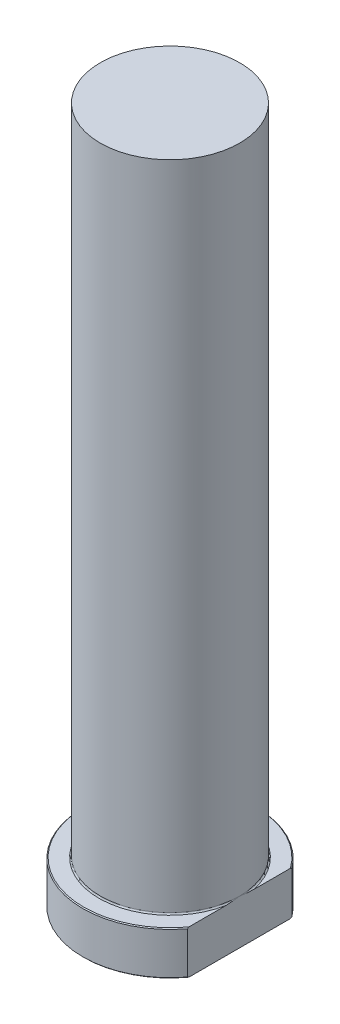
ISO-10303-21;
HEADER;
FILE_DESCRIPTION(('STEP AP214'),'2;1');
FILE_NAME('part.step','',(''),(''),'','','');
FILE_SCHEMA(('AUTOMOTIVE_DESIGN { 1 0 10303 214 1 1 1 1 }'));
ENDSEC;
DATA;
#1=APPLICATION_CONTEXT('core data for automotive mechanical design processes');
#2=APPLICATION_PROTOCOL_DEFINITION('international standard','automotive_design',2000,#1);
#3=PRODUCT_CONTEXT('',#1,'mechanical');
#4=PRODUCT('Part','Part','',(#3));
#5=PRODUCT_RELATED_PRODUCT_CATEGORY('part','',(#4));
#6=PRODUCT_DEFINITION_FORMATION('','',#4);
#7=PRODUCT_DEFINITION_CONTEXT('part definition',#1,'design');
#8=PRODUCT_DEFINITION('design','',#6,#7);
#9=PRODUCT_DEFINITION_SHAPE('','',#8);
#10=(LENGTH_UNIT() NAMED_UNIT(*) SI_UNIT(.MILLI.,.METRE.));
#11=(NAMED_UNIT(*) PLANE_ANGLE_UNIT() SI_UNIT($,.RADIAN.));
#12=(NAMED_UNIT(*) SI_UNIT($,.STERADIAN.) SOLID_ANGLE_UNIT());
#13=UNCERTAINTY_MEASURE_WITH_UNIT(LENGTH_MEASURE(1.E-05),#10,'distance_accuracy_value','');
#14=(GEOMETRIC_REPRESENTATION_CONTEXT(3) GLOBAL_UNCERTAINTY_ASSIGNED_CONTEXT((#13)) GLOBAL_UNIT_ASSIGNED_CONTEXT((#10,
#11,#12)) REPRESENTATION_CONTEXT('',''));
#15=CARTESIAN_POINT('',(0.,0.,0.));
#16=DIRECTION('',(0.,0.,1.));
#17=DIRECTION('',(1.,0.,0.));
#18=AXIS2_PLACEMENT_3D('',#15,#16,#17);
#19=CARTESIAN_POINT('',(0.,0.,0.));
#20=DIRECTION('',(0.,-1.,0.));
#21=DIRECTION('',(0.,0.,-1.));
#22=AXIS2_PLACEMENT_3D('',#19,#20,#21);
#23=PLANE('',#22);
#24=CARTESIAN_POINT('',(0.,0.,0.));
#25=DIRECTION('',(0.,-1.,0.));
#26=DIRECTION('',(0.,0.,-1.));
#27=AXIS2_PLACEMENT_3D('',#24,#25,#26);
#28=CIRCLE('',#27,19.8);
#29=CARTESIAN_POINT('',(16.,0.,11.6636186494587));
#30=VERTEX_POINT('',#29);
#31=CARTESIAN_POINT('',(16.,0.,-11.6636186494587));
#32=VERTEX_POINT('',#31);
#33=EDGE_CURVE('E98',#30,#32,#28,.T.);
#34=ORIENTED_EDGE('',*,*,#33,.T.);
#35=DIRECTION('',(0.,0.,1.));
#36=VECTOR('',#35,1.);
#37=CARTESIAN_POINT('',(16.,0.,-12.));
#38=LINE('',#37,#36);
#39=EDGE_CURVE('E83',#32,#30,#38,.T.);
#40=ORIENTED_EDGE('',*,*,#39,.T.);
#41=EDGE_LOOP('',(#34,#40));
#42=FACE_BOUND('',#41,.T.);
#43=ADVANCED_FACE('F32',(#42),#23,.T.);
#44=CARTESIAN_POINT('',(0.,259.958771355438,0.));
#45=DIRECTION('',(0.,1.,0.));
#46=DIRECTION('',(0.,0.,1.));
#47=AXIS2_PLACEMENT_3D('',#44,#45,#46);
#48=CYLINDRICAL_SURFACE('',#47,20.);
#49=CARTESIAN_POINT('',(0.,9.80000000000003,0.));
#50=DIRECTION('',(0.,1.,0.));
#51=DIRECTION('',(0.,0.,1.));
#52=AXIS2_PLACEMENT_3D('',#49,#50,#51);
#53=CIRCLE('',#52,20.);
#54=CARTESIAN_POINT('',(16.,9.80000000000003,12.));
#55=VERTEX_POINT('',#54);
#56=CARTESIAN_POINT('',(16.,9.80000000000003,-12.));
#57=VERTEX_POINT('',#56);
#58=EDGE_CURVE('E104',#55,#57,#53,.F.);
#59=ORIENTED_EDGE('',*,*,#58,.T.);
#60=DIRECTION('',(0.,-1.,0.));
#61=VECTOR('',#60,1.);
#62=CARTESIAN_POINT('',(16.,160.,-12.));
#63=LINE('',#62,#61);
#64=CARTESIAN_POINT('',(16.,0.199999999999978,-12.));
#65=VERTEX_POINT('',#64);
#66=EDGE_CURVE('E183',#57,#65,#63,.T.);
#67=ORIENTED_EDGE('',*,*,#66,.T.);
#68=CARTESIAN_POINT('',(0.,0.199999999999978,0.));
#69=DIRECTION('',(0.,-1.,0.));
#70=DIRECTION('',(0.,0.,-1.));
#71=AXIS2_PLACEMENT_3D('',#68,#69,#70);
#72=CIRCLE('',#71,20.);
#73=CARTESIAN_POINT('',(16.,0.199999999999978,12.));
#74=VERTEX_POINT('',#73);
#75=EDGE_CURVE('E100',#65,#74,#72,.F.);
#76=ORIENTED_EDGE('',*,*,#75,.T.);
#77=DIRECTION('',(0.,-1.,0.));
#78=VECTOR('',#77,1.);
#79=CARTESIAN_POINT('',(16.,160.,12.));
#80=LINE('',#79,#78);
#81=EDGE_CURVE('E93',#55,#74,#80,.T.);
#82=ORIENTED_EDGE('',*,*,#81,.F.);
#83=EDGE_LOOP('',(#59,#67,#76,#82));
#84=FACE_BOUND('',#83,.T.);
#85=ADVANCED_FACE('F158',(#84),#48,.T.);
#86=CARTESIAN_POINT('',(-20.,10.,0.));
#87=DIRECTION('',(0.,1.,0.));
#88=DIRECTION('',(0.,0.,1.));
#89=AXIS2_PLACEMENT_3D('',#86,#87,#88);
#90=PLANE('',#89);
#91=CARTESIAN_POINT('',(0.,10.,0.));
#92=DIRECTION('',(0.,1.,0.));
#93=DIRECTION('',(0.,0.,1.));
#94=AXIS2_PLACEMENT_3D('',#91,#92,#93);
#95=CIRCLE('',#94,19.8);
#96=CARTESIAN_POINT('',(16.,10.,-11.6636186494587));
#97=VERTEX_POINT('',#96);
#98=CARTESIAN_POINT('',(16.,10.,11.6636186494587));
#99=VERTEX_POINT('',#98);
#100=EDGE_CURVE('E178',#97,#99,#95,.T.);
#101=ORIENTED_EDGE('',*,*,#100,.T.);
#102=DIRECTION('',(0.,0.,-1.));
#103=VECTOR('',#102,1.);
#104=CARTESIAN_POINT('',(16.,10.,0.));
#105=LINE('',#104,#103);
#106=CARTESIAN_POINT('',(16.,10.,3.1128764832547));
#107=VERTEX_POINT('',#106);
#108=EDGE_CURVE('E57',#99,#107,#105,.T.);
#109=ORIENTED_EDGE('',*,*,#108,.T.);
#110=CARTESIAN_POINT('',(0.,10.,0.));
#111=DIRECTION('',(0.,1.,0.));
#112=DIRECTION('',(0.,0.,1.));
#113=AXIS2_PLACEMENT_3D('',#110,#111,#112);
#114=CIRCLE('',#113,16.3);
#115=CARTESIAN_POINT('',(16.,10.,-3.11287648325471));
#116=VERTEX_POINT('',#115);
#117=EDGE_CURVE('E107',#107,#116,#114,.F.);
#118=ORIENTED_EDGE('',*,*,#117,.T.);
#119=EDGE_CURVE('E136',#116,#97,#105,.T.);
#120=ORIENTED_EDGE('',*,*,#119,.T.);
#121=EDGE_LOOP('',(#101,#109,#118,#120));
#122=FACE_BOUND('',#121,.T.);
#123=ADVANCED_FACE('F147',(#122),#90,.T.);
#124=CARTESIAN_POINT('',(0.,10.,0.));
#125=DIRECTION('',(0.,-1.,0.));
#126=DIRECTION('',(0.,0.,-1.));
#127=AXIS2_PLACEMENT_3D('',#124,#125,#126);
#128=CONICAL_SURFACE('',#127,19.8,0.785398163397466);
#129=ORIENTED_EDGE('',*,*,#58,.F.);
#130=CARTESIAN_POINT('',(16.,-1.07064884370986,26.4006999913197));
#131=CARTESIAN_POINT('',(16.,-0.733156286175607,26.0060486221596));
#132=CARTESIAN_POINT('',(16.,-0.396819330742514,25.6104050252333));
#133=CARTESIAN_POINT('',(16.,0.273206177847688,24.8168690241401));
#134=CARTESIAN_POINT('',(16.,0.606894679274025,24.4189765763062));
#135=CARTESIAN_POINT('',(16.,1.27144329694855,23.6204891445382));
#136=CARTESIAN_POINT('',(16.,1.60230187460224,23.2198928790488));
#137=CARTESIAN_POINT('',(16.,2.26059114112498,22.4158945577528));
#138=CARTESIAN_POINT('',(16.,2.58802184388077,22.0124925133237));
#139=CARTESIAN_POINT('',(16.,3.24766747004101,21.1916872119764));
#140=CARTESIAN_POINT('',(16.,3.57977582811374,20.7741982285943));
#141=CARTESIAN_POINT('',(16.,4.23919239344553,19.9354474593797));
#142=CARTESIAN_POINT('',(16.,4.56650063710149,19.5141857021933));
#143=CARTESIAN_POINT('',(16.,5.21544461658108,18.6674666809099));
#144=CARTESIAN_POINT('',(16.,5.53708166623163,18.2420104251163));
#145=CARTESIAN_POINT('',(16.,6.17378218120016,17.3861997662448));
#146=CARTESIAN_POINT('',(16.,6.48884565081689,16.9558453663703));
#147=CARTESIAN_POINT('',(16.,7.11176935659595,16.0887218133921));
#148=CARTESIAN_POINT('',(16.,7.41961501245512,15.6519421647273));
#149=CARTESIAN_POINT('',(16.,8.02597466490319,14.7719292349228));
#150=CARTESIAN_POINT('',(16.,8.32448855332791,14.3286958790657));
#151=CARTESIAN_POINT('',(16.,8.9105299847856,13.4344389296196));
#152=CARTESIAN_POINT('',(16.,9.19804754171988,12.9834087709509));
#153=CARTESIAN_POINT('',(16.,9.75938980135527,12.0728858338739));
#154=CARTESIAN_POINT('',(16.,10.0332147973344,11.6133932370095));
#155=CARTESIAN_POINT('',(16.,10.5615335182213,10.6892898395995));
#156=CARTESIAN_POINT('',(16.,10.816189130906,10.2247720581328));
#157=CARTESIAN_POINT('',(16.,11.3053445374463,9.28510847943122));
#158=CARTESIAN_POINT('',(16.,11.5398419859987,8.80996145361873));
#159=CARTESIAN_POINT('',(16.,11.9836278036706,7.84885100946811));
#160=CARTESIAN_POINT('',(16.,12.1929556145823,7.36290596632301));
#161=CARTESIAN_POINT('',(16.,12.5811435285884,6.37912337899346));
#162=CARTESIAN_POINT('',(16.,12.7600157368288,5.88129064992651));
#163=CARTESIAN_POINT('',(16.,13.0861366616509,4.85753764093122));
#164=CARTESIAN_POINT('',(16.,13.2321910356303,4.33122827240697));
#165=CARTESIAN_POINT('',(16.,13.4164504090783,3.533797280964));
#166=CARTESIAN_POINT('',(16.,13.4720698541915,3.26663533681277));
#167=CARTESIAN_POINT('',(16.,13.5709016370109,2.73003918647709));
#168=CARTESIAN_POINT('',(16.,13.6141156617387,2.4606052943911));
#169=CARTESIAN_POINT('',(16.,13.6872774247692,1.92117630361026));
#170=CARTESIAN_POINT('',(16.,13.7172841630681,1.65118922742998));
#171=CARTESIAN_POINT('',(16.,13.7638048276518,1.11005042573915));
#172=CARTESIAN_POINT('',(16.,13.7803188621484,0.838898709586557));
#173=CARTESIAN_POINT('',(16.,13.7995586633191,0.296109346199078));
#174=CARTESIAN_POINT('',(16.,13.8022847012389,0.0244717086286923));
#175=CARTESIAN_POINT('',(16.,13.7939006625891,-0.518588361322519));
#176=CARTESIAN_POINT('',(16.,13.7827905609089,-0.790010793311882));
#177=CARTESIAN_POINT('',(16.,13.7469663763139,-1.33142514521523));
#178=CARTESIAN_POINT('',(16.,13.7222788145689,-1.60141882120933));
#179=CARTESIAN_POINT('',(16.,13.6597540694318,-2.13989179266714));
#180=CARTESIAN_POINT('',(16.,13.6219151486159,-2.40837088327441));
#181=CARTESIAN_POINT('',(16.,13.4895557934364,-3.21066813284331));
#182=CARTESIAN_POINT('',(16.,13.3761851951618,-3.74145456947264));
#183=CARTESIAN_POINT('',(16.,13.104850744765,-4.79469191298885));
#184=CARTESIAN_POINT('',(16.,12.9466209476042,-5.31707285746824));
#185=CARTESIAN_POINT('',(16.,12.6815624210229,-6.09095035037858));
#186=CARTESIAN_POINT('',(16.,12.5885858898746,-6.34730496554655));
#187=CARTESIAN_POINT('',(16.,12.3942381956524,-6.85681818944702));
#188=CARTESIAN_POINT('',(16.,12.2928668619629,-7.10997673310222));
#189=CARTESIAN_POINT('',(16.,11.9087737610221,-8.02895093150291));
#190=CARTESIAN_POINT('',(16.,11.6032209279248,-8.68528507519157));
#191=CARTESIAN_POINT('',(16.,10.9520387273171,-9.97785473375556));
#192=CARTESIAN_POINT('',(16.,10.6063845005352,-10.6140774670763));
#193=CARTESIAN_POINT('',(16.,9.88410853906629,-11.8704402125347));
#194=CARTESIAN_POINT('',(16.,9.50742027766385,-12.4905417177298));
#195=CARTESIAN_POINT('',(16.,8.73104614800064,-13.7158784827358));
#196=CARTESIAN_POINT('',(16.,8.33136526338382,-14.3211169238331));
#197=CARTESIAN_POINT('',(16.,7.51225576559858,-15.5221520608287));
#198=CARTESIAN_POINT('',(16.,7.09274396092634,-16.1178917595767));
#199=CARTESIAN_POINT('',(16.,6.23957009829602,-17.2991512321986));
#200=CARTESIAN_POINT('',(16.,5.80590743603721,-17.884670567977));
#201=CARTESIAN_POINT('',(16.,4.92783508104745,-19.0464967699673));
#202=CARTESIAN_POINT('',(16.,4.48343853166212,-19.6228135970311));
#203=CARTESIAN_POINT('',(16.,3.58557777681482,-20.7683027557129));
#204=CARTESIAN_POINT('',(16.,3.13211380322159,-21.3374752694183));
#205=CARTESIAN_POINT('',(16.,2.36744022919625,-22.2844266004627));
#206=CARTESIAN_POINT('',(16.,2.05826684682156,-22.6638539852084));
#207=CARTESIAN_POINT('',(16.,1.43690833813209,-23.4203229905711));
#208=CARTESIAN_POINT('',(16.,1.12472279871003,-23.7973642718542));
#209=CARTESIAN_POINT('',(16.,0.499956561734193,-24.5465888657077));
#210=CARTESIAN_POINT('',(16.,0.187394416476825,-24.918787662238));
#211=CARTESIAN_POINT('',(16.,-0.439990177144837,-25.6611808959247));
#212=CARTESIAN_POINT('',(16.,-0.754812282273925,-26.031375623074));
#213=CARTESIAN_POINT('',(16.,-1.07064884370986,-26.4006999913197));
#214=B_SPLINE_CURVE_WITH_KNOTS('',3,(#130,#131,#132,#133,#134,#135,#136,#137,#138,#139,#140,
#141,#142,#143,#144,#145,#146,#147,#148,#149,#150,#151,#152,#153,#154,#155,#156,#157,#158,#159,
#160,#161,#162,#163,#164,#165,#166,#167,#168,#169,#170,#171,#172,#173,#174,#175,#176,#177,#178,
#179,#180,#181,#182,#183,#184,#185,#186,#187,#188,#189,#190,#191,#192,#193,#194,#195,#196,#197,
#198,#199,#200,#201,#202,#203,#204,#205,#206,#207,#208,#209,#210,#211,#212,#213),.UNSPECIFIED.,
.F.,.F.,(4,2,2,2,2,2,2,2,2,2,2,2,2,2,2,2,2,2,2,2,2,2,2,2,2,2,2,2,2,2,2,2,2,2,2,2,2,2,2,2,2,4),
(0.,1.55783999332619,3.11571034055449,4.67437978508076,6.23304291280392,7.83343038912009,
9.43380572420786,11.0338053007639,12.6338038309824,14.2367959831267,15.8398067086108,
17.4442401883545,19.0486392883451,20.6374598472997,22.2264650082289,23.8129467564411,
25.398796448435,27.0353648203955,27.853792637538,28.6721091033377,29.4867319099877,
30.3013481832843,31.1159484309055,31.9305501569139,32.7435663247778,33.556689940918,
35.1826128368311,36.8183840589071,37.6363419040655,38.4543163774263,40.6241539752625,
42.7953439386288,44.9713157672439,47.1468177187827,49.3324366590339,51.5181490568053,
53.7013086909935,55.8844125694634,57.3527237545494,58.8212392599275,60.2793254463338,
61.737194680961),.UNSPECIFIED.);
#215=EDGE_CURVE('E135',#55,#99,#214,.T.);
#216=ORIENTED_EDGE('',*,*,#215,.T.);
#217=ORIENTED_EDGE('',*,*,#100,.F.);
#218=EDGE_CURVE('E127',#97,#57,#214,.T.);
#219=ORIENTED_EDGE('',*,*,#218,.T.);
#220=EDGE_LOOP('',(#129,#216,#217,#219));
#221=FACE_BOUND('',#220,.T.);
#222=ADVANCED_FACE('F143',(#221),#128,.T.);
#223=CARTESIAN_POINT('',(0.,0.199999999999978,0.));
#224=DIRECTION('',(0.,1.,0.));
#225=DIRECTION('',(0.,0.,1.));
#226=AXIS2_PLACEMENT_3D('',#223,#224,#225);
#227=CONICAL_SURFACE('',#226,20.,0.785398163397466);
#228=ORIENTED_EDGE('',*,*,#75,.F.);
#229=CARTESIAN_POINT('',(16.,11.0706488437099,-26.4006999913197));
#230=CARTESIAN_POINT('',(16.,10.7331562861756,-26.0060486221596));
#231=CARTESIAN_POINT('',(16.,10.3968193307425,-25.6104050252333));
#232=CARTESIAN_POINT('',(16.,9.72679382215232,-24.8168690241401));
#233=CARTESIAN_POINT('',(16.,9.39310532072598,-24.4189765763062));
#234=CARTESIAN_POINT('',(16.,8.72855670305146,-23.6204891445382));
#235=CARTESIAN_POINT('',(16.,8.39769812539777,-23.2198928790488));
#236=CARTESIAN_POINT('',(16.,7.73940885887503,-22.4158945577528));
#237=CARTESIAN_POINT('',(16.,7.41197815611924,-22.0124925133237));
#238=CARTESIAN_POINT('',(16.,6.752332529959,-21.1916872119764));
#239=CARTESIAN_POINT('',(16.,6.42022417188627,-20.7741982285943));
#240=CARTESIAN_POINT('',(16.,5.76080760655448,-19.9354474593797));
#241=CARTESIAN_POINT('',(16.,5.43349936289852,-19.5141857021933));
#242=CARTESIAN_POINT('',(16.,4.78455538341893,-18.6674666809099));
#243=CARTESIAN_POINT('',(16.,4.46291833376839,-18.2420104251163));
#244=CARTESIAN_POINT('',(16.,3.82621781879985,-17.3861997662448));
#245=CARTESIAN_POINT('',(16.,3.51115434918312,-16.9558453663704));
#246=CARTESIAN_POINT('',(16.,2.88823064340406,-16.0887218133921));
#247=CARTESIAN_POINT('',(16.,2.58038498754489,-15.6519421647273));
#248=CARTESIAN_POINT('',(16.,1.97402533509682,-14.7719292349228));
#249=CARTESIAN_POINT('',(16.,1.6755114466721,-14.3286958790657));
#250=CARTESIAN_POINT('',(16.,1.08947001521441,-13.4344389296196));
#251=CARTESIAN_POINT('',(16.,0.801952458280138,-12.9834087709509));
#252=CARTESIAN_POINT('',(16.,0.240610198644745,-12.0728858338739));
#253=CARTESIAN_POINT('',(16.,-0.0332147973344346,-11.6133932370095));
#254=CARTESIAN_POINT('',(16.,-0.561533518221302,-10.6892898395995));
#255=CARTESIAN_POINT('',(16.,-0.816189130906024,-10.2247720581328));
#256=CARTESIAN_POINT('',(16.,-1.30534453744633,-9.28510847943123));
#257=CARTESIAN_POINT('',(16.,-1.5398419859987,-8.80996145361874));
#258=CARTESIAN_POINT('',(16.,-1.98362780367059,-7.84885100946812));
#259=CARTESIAN_POINT('',(16.,-2.19295561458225,-7.36290596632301));
#260=CARTESIAN_POINT('',(16.,-2.58114352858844,-6.37912337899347));
#261=CARTESIAN_POINT('',(16.,-2.76001573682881,-5.88129064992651));
#262=CARTESIAN_POINT('',(16.,-3.08613666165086,-4.85753764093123));
#263=CARTESIAN_POINT('',(16.,-3.23219103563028,-4.33122827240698));
#264=CARTESIAN_POINT('',(16.,-3.41645040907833,-3.53379728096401));
#265=CARTESIAN_POINT('',(16.,-3.47206985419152,-3.26663533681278));
#266=CARTESIAN_POINT('',(16.,-3.57090163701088,-2.7300391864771));
#267=CARTESIAN_POINT('',(16.,-3.61411566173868,-2.46060529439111));
#268=CARTESIAN_POINT('',(16.,-3.6872774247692,-1.92117630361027));
#269=CARTESIAN_POINT('',(16.,-3.71728416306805,-1.65118922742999));
#270=CARTESIAN_POINT('',(16.,-3.76380482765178,-1.11005042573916));
#271=CARTESIAN_POINT('',(16.,-3.78031886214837,-0.838898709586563));
#272=CARTESIAN_POINT('',(16.,-3.79955866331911,-0.296109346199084));
#273=CARTESIAN_POINT('',(16.,-3.80228470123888,-0.0244717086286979));
#274=CARTESIAN_POINT('',(16.,-3.79390066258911,0.518588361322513));
#275=CARTESIAN_POINT('',(16.,-3.78279056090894,0.790010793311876));
#276=CARTESIAN_POINT('',(16.,-3.74696637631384,1.33142514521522));
#277=CARTESIAN_POINT('',(16.,-3.7222788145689,1.60141882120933));
#278=CARTESIAN_POINT('',(16.,-3.65975406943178,2.13989179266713));
#279=CARTESIAN_POINT('',(16.,-3.62191514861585,2.40837088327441));
#280=CARTESIAN_POINT('',(16.,-3.48955579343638,3.21066813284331));
#281=CARTESIAN_POINT('',(16.,-3.37618519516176,3.74145456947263));
#282=CARTESIAN_POINT('',(16.,-3.10485074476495,4.79469191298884));
#283=CARTESIAN_POINT('',(16.,-2.94662094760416,5.31707285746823));
#284=CARTESIAN_POINT('',(16.,-2.68156242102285,6.09095035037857));
#285=CARTESIAN_POINT('',(16.,-2.58858588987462,6.34730496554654));
#286=CARTESIAN_POINT('',(16.,-2.39423819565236,6.85681818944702));
#287=CARTESIAN_POINT('',(16.,-2.29286686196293,7.10997673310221));
#288=CARTESIAN_POINT('',(16.,-1.90877376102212,8.0289509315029));
#289=CARTESIAN_POINT('',(16.,-1.6032209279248,8.68528507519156));
#290=CARTESIAN_POINT('',(16.,-0.952038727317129,9.97785473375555));
#291=CARTESIAN_POINT('',(16.,-0.606384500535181,10.6140774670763));
#292=CARTESIAN_POINT('',(16.,0.115891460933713,11.8704402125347));
#293=CARTESIAN_POINT('',(16.,0.492579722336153,12.4905417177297));
#294=CARTESIAN_POINT('',(16.,1.26895385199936,13.7158784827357));
#295=CARTESIAN_POINT('',(16.,1.66863473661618,14.3211169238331));
#296=CARTESIAN_POINT('',(16.,2.48774423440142,15.5221520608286));
#297=CARTESIAN_POINT('',(16.,2.90725603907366,16.1178917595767));
#298=CARTESIAN_POINT('',(16.,3.76042990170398,17.2991512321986));
#299=CARTESIAN_POINT('',(16.,4.19409256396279,17.884670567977));
#300=CARTESIAN_POINT('',(16.,5.07216491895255,19.0464967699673));
#301=CARTESIAN_POINT('',(16.,5.51656146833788,19.622813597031));
#302=CARTESIAN_POINT('',(16.,6.41442222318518,20.7683027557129));
#303=CARTESIAN_POINT('',(16.,6.8678861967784,21.3374752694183));
#304=CARTESIAN_POINT('',(16.,7.63255977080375,22.2844266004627));
#305=CARTESIAN_POINT('',(16.,7.94173315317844,22.6638539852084));
#306=CARTESIAN_POINT('',(16.,8.56309166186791,23.4203229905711));
#307=CARTESIAN_POINT('',(16.,8.87527720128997,23.7973642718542));
#308=CARTESIAN_POINT('',(16.,9.50004343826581,24.5465888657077));
#309=CARTESIAN_POINT('',(16.,9.81260558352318,24.918787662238));
#310=CARTESIAN_POINT('',(16.,10.4399901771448,25.6611808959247));
#311=CARTESIAN_POINT('',(16.,10.7548122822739,26.031375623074));
#312=CARTESIAN_POINT('',(16.,11.0706488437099,26.4006999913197));
#313=B_SPLINE_CURVE_WITH_KNOTS('',3,(#229,#230,#231,#232,#233,#234,#235,#236,#237,#238,#239,
#240,#241,#242,#243,#244,#245,#246,#247,#248,#249,#250,#251,#252,#253,#254,#255,#256,#257,#258,
#259,#260,#261,#262,#263,#264,#265,#266,#267,#268,#269,#270,#271,#272,#273,#274,#275,#276,#277,
#278,#279,#280,#281,#282,#283,#284,#285,#286,#287,#288,#289,#290,#291,#292,#293,#294,#295,#296,
#297,#298,#299,#300,#301,#302,#303,#304,#305,#306,#307,#308,#309,#310,#311,#312),.UNSPECIFIED.,
.F.,.F.,(4,2,2,2,2,2,2,2,2,2,2,2,2,2,2,2,2,2,2,2,2,2,2,2,2,2,2,2,2,2,2,2,2,2,2,2,2,2,2,2,2,4),
(0.,1.55783999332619,3.11571034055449,4.67437978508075,6.23304291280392,7.83343038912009,
9.43380572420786,11.0338053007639,12.6338038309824,14.2367959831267,15.8398067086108,
17.4442401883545,19.0486392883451,20.6374598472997,22.2264650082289,23.8129467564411,
25.398796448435,27.0353648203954,27.853792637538,28.6721091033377,29.4867319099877,
30.3013481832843,31.1159484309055,31.9305501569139,32.7435663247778,33.556689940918,
35.1826128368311,36.8183840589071,37.6363419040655,38.4543163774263,40.6241539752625,
42.7953439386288,44.9713157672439,47.1468177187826,49.3324366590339,51.5181490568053,
53.7013086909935,55.8844125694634,57.3527237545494,58.8212392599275,60.2793254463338,
61.737194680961),.UNSPECIFIED.);
#314=EDGE_CURVE('E86',#65,#32,#313,.T.);
#315=ORIENTED_EDGE('',*,*,#314,.T.);
#316=ORIENTED_EDGE('',*,*,#33,.F.);
#317=EDGE_CURVE('E89',#30,#74,#313,.T.);
#318=ORIENTED_EDGE('',*,*,#317,.T.);
#319=EDGE_LOOP('',(#228,#315,#316,#318));
#320=FACE_BOUND('',#319,.T.);
#321=ADVANCED_FACE('F97',(#320),#227,.T.);
#322=CARTESIAN_POINT('',(0.,10.3,0.));
#323=DIRECTION('',(0.,1.,0.));
#324=DIRECTION('',(0.,0.,1.));
#325=AXIS2_PLACEMENT_3D('',#322,#323,#324);
#326=TOROIDAL_SURFACE('',#325,16.3,0.3);
#327=CARTESIAN_POINT('',(16.,10.3,0.));
#328=CARTESIAN_POINT('',(16.,10.3000006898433,-5.33715911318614E-09));
#329=CARTESIAN_POINT('',(16.,10.3000013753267,-5.90477996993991E-07));
#330=CARTESIAN_POINT('',(16.,10.3000026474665,-1.99315110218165E-06));
#331=CARTESIAN_POINT('',(16.,10.3000031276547,-2.82387138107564E-06));
#332=CARTESIAN_POINT('',(16.,10.300004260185,-4.93201352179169E-06));
#333=CARTESIAN_POINT('',(16.,10.300004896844,-6.24688723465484E-06));
#334=CARTESIAN_POINT('',(16.,10.3000059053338,-8.79561581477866E-06));
#335=CARTESIAN_POINT('',(16.,10.3000062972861,-1.00244169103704E-05));
#336=CARTESIAN_POINT('',(16.,10.3000079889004,-1.53269558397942E-05));
#337=CARTESIAN_POINT('',(16.,10.3000092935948,-1.94146126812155E-05));
#338=CARTESIAN_POINT('',(16.,10.3000111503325,-2.70530674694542E-05));
#339=CARTESIAN_POINT('',(16.,10.300011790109,-3.05834546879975E-05));
#340=CARTESIAN_POINT('',(16.,10.3000164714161,-5.69924666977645E-05));
#341=CARTESIAN_POINT('',(16.,10.3000199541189,-7.99464318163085E-05));
#342=CARTESIAN_POINT('',(16.,10.3000322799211,-0.000171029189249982));
#343=CARTESIAN_POINT('',(16.,10.3000382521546,-0.000239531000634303));
#344=CARTESIAN_POINT('',(16.,10.3000656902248,-0.00050618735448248));
#345=CARTESIAN_POINT('',(16.,10.3000950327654,-0.0007033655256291));
#346=CARTESIAN_POINT('',(16.,10.3002038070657,-0.0014556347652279));
#347=CARTESIAN_POINT('',(16.,10.300277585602,-0.00201139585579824));
#348=CARTESIAN_POINT('',(16.,10.3005644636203,-0.00414914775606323));
#349=CARTESIAN_POINT('',(16.,10.300783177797,-0.00573048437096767));
#350=CARTESIAN_POINT('',(16.,10.3018172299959,-0.0132287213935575));
#351=CARTESIAN_POINT('',(16.,10.3026243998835,-0.0191465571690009));
#352=CARTESIAN_POINT('',(16.,10.3110865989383,-0.0811528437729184));
#353=CARTESIAN_POINT('',(16.,10.3187815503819,-0.137236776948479));
#354=CARTESIAN_POINT('',(16.,10.3348868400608,-0.255096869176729));
#355=CARTESIAN_POINT('',(16.,10.343290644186,-0.316873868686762));
#356=CARTESIAN_POINT('',(16.,10.3571569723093,-0.419331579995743));
#357=CARTESIAN_POINT('',(16.,10.3626434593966,-0.460008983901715));
#358=CARTESIAN_POINT('',(16.,10.3734224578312,-0.540334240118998));
#359=CARTESIAN_POINT('',(16.,10.3787163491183,-0.579981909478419));
#360=CARTESIAN_POINT('',(16.,10.4083966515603,-0.803619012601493));
#361=CARTESIAN_POINT('',(16.,10.4321379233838,-0.987696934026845));
#362=CARTESIAN_POINT('',(16.,10.4771585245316,-1.35808125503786));
#363=CARTESIAN_POINT('',(16.,10.4984099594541,-1.54439106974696));
#364=CARTESIAN_POINT('',(16.,10.5392977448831,-1.94430528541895));
#365=CARTESIAN_POINT('',(16.,10.5582626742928,-2.15798298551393));
#366=CARTESIAN_POINT('',(16.,10.5798230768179,-2.47853128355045));
#367=CARTESIAN_POINT('',(16.,10.5858566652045,-2.58516682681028));
#368=CARTESIAN_POINT('',(16.,10.5950189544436,-2.79855398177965));
#369=CARTESIAN_POINT('',(16.,10.5981480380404,-2.90530557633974));
#370=CARTESIAN_POINT('',(16.,10.6006064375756,-3.11480969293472));
#371=CARTESIAN_POINT('',(16.,10.600075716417,-3.21755992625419));
#372=CARTESIAN_POINT('',(16.,10.5957602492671,-3.37181907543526));
#373=CARTESIAN_POINT('',(16.,10.593726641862,-3.42337702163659));
#374=CARTESIAN_POINT('',(16.,10.5882429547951,-3.52640582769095));
#375=CARTESIAN_POINT('',(16.,10.584793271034,-3.57787670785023));
#376=CARTESIAN_POINT('',(16.,10.5763123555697,-3.67890194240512));
#377=CARTESIAN_POINT('',(16.,10.5713398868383,-3.72846106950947));
#378=CARTESIAN_POINT('',(16.,10.5593485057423,-3.82738811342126));
#379=CARTESIAN_POINT('',(16.,10.5523274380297,-3.87675577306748));
#380=CARTESIAN_POINT('',(16.,10.5356271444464,-3.97473922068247));
#381=CARTESIAN_POINT('',(16.,10.5259654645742,-4.02335780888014));
#382=CARTESIAN_POINT('',(16.,10.5085240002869,-4.09553189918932));
#383=CARTESIAN_POINT('',(16.,10.5022253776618,-4.11944402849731));
#384=CARTESIAN_POINT('',(16.,10.4883597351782,-4.16689390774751));
#385=CARTESIAN_POINT('',(16.,10.4807934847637,-4.19043187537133));
#386=CARTESIAN_POINT('',(16.,10.468072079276,-4.22548932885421));
#387=CARTESIAN_POINT('',(16.,10.463554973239,-4.23724015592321));
#388=CARTESIAN_POINT('',(16.,10.4539723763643,-4.2605292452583));
#389=CARTESIAN_POINT('',(16.,10.4489064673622,-4.27206733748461));
#390=CARTESIAN_POINT('',(16.,10.4380905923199,-4.29485009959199));
#391=CARTESIAN_POINT('',(16.,10.4323392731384,-4.30609413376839));
#392=CARTESIAN_POINT('',(16.,10.4199753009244,-4.32809262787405));
#393=CARTESIAN_POINT('',(16.,10.4133636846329,-4.33884765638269));
#394=CARTESIAN_POINT('',(16.,10.3989169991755,-4.35969720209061));
#395=CARTESIAN_POINT('',(16.,10.3910687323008,-4.36978269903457));
#396=CARTESIAN_POINT('',(16.,10.3737930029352,-4.38847604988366));
#397=CARTESIAN_POINT('',(16.,10.3643793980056,-4.39709563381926));
#398=CARTESIAN_POINT('',(16.,10.349684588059,-4.40721260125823));
#399=CARTESIAN_POINT('',(16.,10.3452411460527,-4.40991204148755));
#400=CARTESIAN_POINT('',(16.,10.3360120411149,-4.41465735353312));
#401=CARTESIAN_POINT('',(16.,10.331226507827,-4.41670347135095));
#402=CARTESIAN_POINT('',(16.,10.321316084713,-4.41997867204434));
#403=CARTESIAN_POINT('',(16.,10.3161880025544,-4.42119837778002));
#404=CARTESIAN_POINT('',(16.,10.3057936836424,-4.42262740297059));
#405=CARTESIAN_POINT('',(16.,10.3005276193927,-4.42283792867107));
#406=CARTESIAN_POINT('',(16.,10.2906214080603,-4.42225569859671));
#407=CARTESIAN_POINT('',(16.,10.285974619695,-4.42156796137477));
#408=CARTESIAN_POINT('',(16.,10.2768560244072,-4.41944337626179));
#409=CARTESIAN_POINT('',(16.,10.2723843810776,-4.41800584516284));
#410=CARTESIAN_POINT('',(16.,10.2619701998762,-4.41381248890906));
#411=CARTESIAN_POINT('',(16.,10.2561483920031,-4.4107598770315));
#412=CARTESIAN_POINT('',(16.,10.2450526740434,-4.40378684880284));
#413=CARTESIAN_POINT('',(16.,10.239780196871,-4.39986424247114));
#414=CARTESIAN_POINT('',(16.,10.2257729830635,-4.38808908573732));
#415=CARTESIAN_POINT('',(16.,10.2175965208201,-4.37958133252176));
#416=CARTESIAN_POINT('',(16.,10.2024790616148,-4.36154434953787));
#417=CARTESIAN_POINT('',(16.,10.1955419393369,-4.35201206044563));
#418=CARTESIAN_POINT('',(16.,10.1791886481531,-4.32717029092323));
#419=CARTESIAN_POINT('',(16.,10.1703884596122,-4.31145991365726));
#420=CARTESIAN_POINT('',(16.,10.154248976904,-4.2792945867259));
#421=CARTESIAN_POINT('',(16.,10.1469131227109,-4.26283799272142));
#422=CARTESIAN_POINT('',(16.,10.1332947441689,-4.22939871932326));
#423=CARTESIAN_POINT('',(16.,10.1270179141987,-4.2124137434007));
#424=CARTESIAN_POINT('',(16.,10.1153239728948,-4.17817736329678));
#425=CARTESIAN_POINT('',(16.,10.1099058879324,-4.16092628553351));
#426=CARTESIAN_POINT('',(16.,10.0949674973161,-4.10989946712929));
#427=CARTESIAN_POINT('',(16.,10.0863847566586,-4.07584989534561));
#428=CARTESIAN_POINT('',(16.,10.0710343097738,-4.00733871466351));
#429=CARTESIAN_POINT('',(16.,10.0642677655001,-3.97287685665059));
#430=CARTESIAN_POINT('',(16.,10.0460186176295,-3.86898411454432));
#431=CARTESIAN_POINT('',(16.,10.036623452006,-3.79918851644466));
#432=CARTESIAN_POINT('',(16.,10.0215249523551,-3.65915321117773));
#433=CARTESIAN_POINT('',(16.,10.0158261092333,-3.58891306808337));
#434=CARTESIAN_POINT('',(16.,10.0072116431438,-3.44836432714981));
#435=CARTESIAN_POINT('',(16.,10.00429218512,-3.37805595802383));
#436=CARTESIAN_POINT('',(16.,10.000668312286,-3.23904020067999));
#437=CARTESIAN_POINT('',(16.,9.99991350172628,-3.17033397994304));
#438=CARTESIAN_POINT('',(16.,10.0001018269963,-3.03292208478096));
#439=CARTESIAN_POINT('',(16.,10.0010450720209,-2.96421641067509));
#440=CARTESIAN_POINT('',(16.,10.0059904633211,-2.75810886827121));
#441=CARTESIAN_POINT('',(16.,10.0121089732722,-2.62075798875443));
#442=CARTESIAN_POINT('',(16.,10.0284391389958,-2.34612718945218));
#443=CARTESIAN_POINT('',(16.,10.0386564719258,-2.20884763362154));
#444=CARTESIAN_POINT('',(16.,10.0621466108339,-1.93454208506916));
#445=CARTESIAN_POINT('',(16.,10.075419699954,-1.79751611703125));
#446=CARTESIAN_POINT('',(16.,10.118522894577,-1.38740066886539));
#447=CARTESIAN_POINT('',(16.,10.1516806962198,-1.11466812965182));
#448=CARTESIAN_POINT('',(16.,10.2220528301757,-0.569702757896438));
#449=CARTESIAN_POINT('',(16.,10.259267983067,-0.297470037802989));
#450=CARTESIAN_POINT('',(16.,10.2965515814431,-0.0251841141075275));
#451=CARTESIAN_POINT('',(16.,10.2965597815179,-0.0251242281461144));
#452=CARTESIAN_POINT('',(16.,10.2972621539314,-0.019994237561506));
#453=CARTESIAN_POINT('',(16.,10.2979507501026,-0.0149234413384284));
#454=CARTESIAN_POINT('',(16.,10.2989595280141,-0.00761717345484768));
#455=CARTESIAN_POINT('',(16.,10.2992705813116,-0.00538056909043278));
#456=CARTESIAN_POINT('',(16.,10.2996656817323,-0.00242425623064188));
#457=CARTESIAN_POINT('',(16.,10.2997604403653,-0.00170587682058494));
#458=CARTESIAN_POINT('',(16.,10.2998960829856,-0.000765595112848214));
#459=CARTESIAN_POINT('',(16.,10.2999290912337,-0.000542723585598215));
#460=CARTESIAN_POINT('',(16.,10.2999593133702,-0.000246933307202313));
#461=CARTESIAN_POINT('',(16.,10.2999656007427,-0.000175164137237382));
#462=CARTESIAN_POINT('',(16.,10.2999790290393,-8.05668880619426E-05));
#463=CARTESIAN_POINT('',(16.,10.2999827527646,-5.72823548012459E-05));
#464=CARTESIAN_POINT('',(16.,10.2999877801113,-3.05492734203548E-05));
#465=CARTESIAN_POINT('',(16.,10.2999884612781,-2.70084595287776E-05));
#466=CARTESIAN_POINT('',(16.,10.2999904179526,-1.93523012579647E-05));
#467=CARTESIAN_POINT('',(16.,10.2999917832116,-1.52589672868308E-05));
#468=CARTESIAN_POINT('',(16.,10.2999935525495,-9.95362422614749E-06));
#469=CARTESIAN_POINT('',(16.,10.2999939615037,-8.72734435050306E-06));
#470=CARTESIAN_POINT('',(16.,10.2999950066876,-6.18658496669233E-06));
#471=CARTESIAN_POINT('',(16.,10.2999956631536,-4.87748836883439E-06));
#472=CARTESIAN_POINT('',(16.,10.2999968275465,-2.7813010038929E-06));
#473=CARTESIAN_POINT('',(16.,10.2999973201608,-1.95628425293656E-06));
#474=CARTESIAN_POINT('',(16.,10.2999986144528,-5.7037197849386E-07));
#475=CARTESIAN_POINT('',(16.,10.299999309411,5.3429283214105E-09));
#476=CARTESIAN_POINT('',(16.,10.3,0.));
#477=B_SPLINE_CURVE_WITH_KNOTS('',3,(#327,#328,#329,#330,#331,#332,#333,#334,#335,#336,#337,
#338,#339,#340,#341,#342,#343,#344,#345,#346,#347,#348,#349,#350,#351,#352,#353,#354,#355,#356,
#357,#358,#359,#360,#361,#362,#363,#364,#365,#366,#367,#368,#369,#370,#371,#372,#373,#374,#375,
#376,#377,#378,#379,#380,#381,#382,#383,#384,#385,#386,#387,#388,#389,#390,#391,#392,#393,#394,
#395,#396,#397,#398,#399,#400,#401,#402,#403,#404,#405,#406,#407,#408,#409,#410,#411,#412,#413,
#414,#415,#416,#417,#418,#419,#420,#421,#422,#423,#424,#425,#426,#427,#428,#429,#430,#431,#432,
#433,#434,#435,#436,#437,#438,#439,#440,#441,#442,#443,#444,#445,#446,#447,#448,#449,#450,#451,
#452,#453,#454,#455,#456,#457,#458,#459,#460,#461,#462,#463,#464,#465,#466,#467,#468,#469,#470,
#471,#472,#473,#474,#475,#476),.UNSPECIFIED.,.T.,.F.,(4,2,2,2,2,2,2,2,2,2,2,2,2,2,2,2,2,2,2,2,2,
2,2,2,2,2,2,2,2,2,2,2,2,2,2,2,2,2,2,2,2,2,2,2,2,2,2,2,2,2,2,2,2,2,2,2,2,2,2,2,2,2,2,2,2,2,2,2,2,
2,2,2,2,2,4),(0.,2.26177734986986E-06,5.26667807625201E-06,9.57510831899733E-06,
1.34525317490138E-05,2.62880070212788E-05,3.70424186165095E-05,0.00010669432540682,
0.000312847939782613,0.00091073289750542,0.00259276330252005,0.00738178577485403,
0.0252998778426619,0.195126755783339,0.382165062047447,0.505302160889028,0.625300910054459,
1.18209491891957,1.74462724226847,2.38803172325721,2.7084197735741,3.02876559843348,
3.33693017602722,3.49170918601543,3.64644495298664,3.79583437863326,3.94538154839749,
4.09395822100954,4.16811893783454,4.24223480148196,4.27999202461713,4.31777822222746,
4.35564029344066,4.39345715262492,4.43170898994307,4.4696386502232,4.485195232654,
4.50074595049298,4.51647028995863,4.53217582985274,4.54619960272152,4.56023617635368,
4.5798446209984,4.59950299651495,4.63470321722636,4.67001163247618,4.72389684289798,
4.77790718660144,4.83219927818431,4.88642936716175,4.99169124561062,5.09702030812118,
5.30811846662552,5.51947262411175,5.73053472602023,5.93664148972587,6.14276150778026,
6.55512598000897,6.96806358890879,7.38103947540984,8.20517107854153,9.0294696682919,
9.02965100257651,9.04500321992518,9.05177741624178,9.05395133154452,9.05462709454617,
9.05484306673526,9.05491380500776,9.05492461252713,9.05493751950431,9.05494140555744,
9.05494572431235,9.05494873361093,9.05495099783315),.UNSPECIFIED.);
#478=CARTESIAN_POINT('',(16.,10.3,0.));
#479=VERTEX_POINT('',#478);
#480=EDGE_CURVE('E11',#116,#479,#477,.T.);
#481=ORIENTED_EDGE('',*,*,#480,.F.);
#482=ORIENTED_EDGE('',*,*,#117,.F.);
#483=CARTESIAN_POINT('',(16.,10.3,0.));
#484=CARTESIAN_POINT('',(16.,10.2999993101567,5.33715953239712E-09));
#485=CARTESIAN_POINT('',(16.,10.2999986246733,5.90477997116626E-07));
#486=CARTESIAN_POINT('',(16.,10.2999973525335,1.99315110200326E-06));
#487=CARTESIAN_POINT('',(16.,10.2999968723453,2.82387138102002E-06));
#488=CARTESIAN_POINT('',(16.,10.299995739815,4.93201352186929E-06));
#489=CARTESIAN_POINT('',(16.,10.299995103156,6.24688723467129E-06));
#490=CARTESIAN_POINT('',(16.,10.2999940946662,8.7956158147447E-06));
#491=CARTESIAN_POINT('',(16.,10.2999937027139,1.00244169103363E-05));
#492=CARTESIAN_POINT('',(16.,10.2999920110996,1.53269558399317E-05));
#493=CARTESIAN_POINT('',(16.,10.2999907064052,1.94146126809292E-05));
#494=CARTESIAN_POINT('',(16.,10.2999888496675,2.70530674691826E-05));
#495=CARTESIAN_POINT('',(16.,10.299988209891,3.05834546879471E-05));
#496=CARTESIAN_POINT('',(16.,10.2999835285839,5.69924666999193E-05));
#497=CARTESIAN_POINT('',(16.,10.2999800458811,7.99464318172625E-05));
#498=CARTESIAN_POINT('',(15.9999999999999,10.2999677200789,0.000171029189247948));
#499=CARTESIAN_POINT('',(16.,10.2999617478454,0.000239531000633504));
#500=CARTESIAN_POINT('',(16.,10.2999343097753,0.000506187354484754));
#501=CARTESIAN_POINT('',(16.,10.2999049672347,0.000703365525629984));
#502=CARTESIAN_POINT('',(15.9999999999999,10.2997961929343,0.00145563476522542));
#503=CARTESIAN_POINT('',(16.,10.299722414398,0.00201139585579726));
#504=CARTESIAN_POINT('',(16.,10.2994355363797,0.004149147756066));
#505=CARTESIAN_POINT('',(16.,10.299216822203,0.00573048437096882));
#506=CARTESIAN_POINT('',(15.9999999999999,10.2981827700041,0.0132287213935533));
#507=CARTESIAN_POINT('',(15.9999999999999,10.2973756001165,0.0191465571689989));
#508=CARTESIAN_POINT('',(16.0000000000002,10.2889134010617,0.0811528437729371));
#509=CARTESIAN_POINT('',(16.,10.2812184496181,0.137236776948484));
#510=CARTESIAN_POINT('',(15.9999999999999,10.2651131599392,0.255096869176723));
#511=CARTESIAN_POINT('',(16.,10.256709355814,0.316873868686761));
#512=CARTESIAN_POINT('',(16.,10.2428430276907,0.419331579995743));
#513=CARTESIAN_POINT('',(16.,10.2373565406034,0.460008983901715));
#514=CARTESIAN_POINT('',(16.,10.2265775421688,0.540334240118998));
#515=CARTESIAN_POINT('',(16.,10.2212836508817,0.579981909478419));
#516=CARTESIAN_POINT('',(16.,10.1916033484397,0.803619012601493));
#517=CARTESIAN_POINT('',(16.,10.1678620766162,0.987696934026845));
#518=CARTESIAN_POINT('',(16.,10.1228414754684,1.35808125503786));
#519=CARTESIAN_POINT('',(16.,10.101590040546,1.54439106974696));
#520=CARTESIAN_POINT('',(16.,10.0607022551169,1.94430528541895));
#521=CARTESIAN_POINT('',(16.,10.0417373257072,2.15798298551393));
#522=CARTESIAN_POINT('',(16.,10.0201769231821,2.47853128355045));
#523=CARTESIAN_POINT('',(16.,10.0141433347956,2.58516682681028));
#524=CARTESIAN_POINT('',(16.,10.0049810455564,2.79855398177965));
#525=CARTESIAN_POINT('',(16.,10.0018519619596,2.90530557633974));
#526=CARTESIAN_POINT('',(16.,9.9993935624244,3.11480969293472));
#527=CARTESIAN_POINT('',(16.,9.99992428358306,3.21755992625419));
#528=CARTESIAN_POINT('',(16.,10.0042397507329,3.37181907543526));
#529=CARTESIAN_POINT('',(16.,10.006273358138,3.42337702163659));
#530=CARTESIAN_POINT('',(16.,10.0117570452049,3.52640582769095));
#531=CARTESIAN_POINT('',(16.,10.015206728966,3.57787670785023));
#532=CARTESIAN_POINT('',(16.,10.0236876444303,3.67890194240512));
#533=CARTESIAN_POINT('',(16.,10.0286601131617,3.72846106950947));
#534=CARTESIAN_POINT('',(16.,10.0406514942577,3.82738811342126));
#535=CARTESIAN_POINT('',(16.,10.0476725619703,3.87675577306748));
#536=CARTESIAN_POINT('',(16.,10.0643728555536,3.97473922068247));
#537=CARTESIAN_POINT('',(16.,10.0740345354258,4.02335780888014));
#538=CARTESIAN_POINT('',(16.,10.0914759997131,4.09553189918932));
#539=CARTESIAN_POINT('',(16.,10.0977746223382,4.11944402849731));
#540=CARTESIAN_POINT('',(16.,10.1116402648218,4.16689390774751));
#541=CARTESIAN_POINT('',(16.,10.1192065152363,4.19043187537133));
#542=CARTESIAN_POINT('',(16.,10.1319279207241,4.22548932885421));
#543=CARTESIAN_POINT('',(16.,10.136445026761,4.23724015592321));
#544=CARTESIAN_POINT('',(16.,10.1460276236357,4.2605292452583));
#545=CARTESIAN_POINT('',(16.,10.1510935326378,4.27206733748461));
#546=CARTESIAN_POINT('',(16.,10.1619094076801,4.29485009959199));
#547=CARTESIAN_POINT('',(16.,10.1676607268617,4.30609413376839));
#548=CARTESIAN_POINT('',(16.,10.1800246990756,4.32809262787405));
#549=CARTESIAN_POINT('',(16.,10.1866363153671,4.33884765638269));
#550=CARTESIAN_POINT('',(16.,10.2010830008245,4.35969720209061));
#551=CARTESIAN_POINT('',(16.,10.2089312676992,4.36978269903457));
#552=CARTESIAN_POINT('',(16.,10.2262069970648,4.38847604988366));
#553=CARTESIAN_POINT('',(16.,10.2356206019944,4.39709563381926));
#554=CARTESIAN_POINT('',(16.,10.250315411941,4.40721260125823));
#555=CARTESIAN_POINT('',(16.,10.2547588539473,4.40991204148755));
#556=CARTESIAN_POINT('',(16.,10.2639879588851,4.41465735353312));
#557=CARTESIAN_POINT('',(16.,10.268773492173,4.41670347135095));
#558=CARTESIAN_POINT('',(16.,10.278683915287,4.41997867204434));
#559=CARTESIAN_POINT('',(16.,10.2838119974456,4.42119837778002));
#560=CARTESIAN_POINT('',(16.,10.2942063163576,4.42262740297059));
#561=CARTESIAN_POINT('',(16.,10.2994723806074,4.42283792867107));
#562=CARTESIAN_POINT('',(16.,10.3093785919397,4.42225569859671));
#563=CARTESIAN_POINT('',(16.,10.314025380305,4.42156796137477));
#564=CARTESIAN_POINT('',(16.,10.3231439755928,4.41944337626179));
#565=CARTESIAN_POINT('',(16.,10.3276156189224,4.41800584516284));
#566=CARTESIAN_POINT('',(16.,10.3380298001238,4.41381248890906));
#567=CARTESIAN_POINT('',(16.,10.3438516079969,4.4107598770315));
#568=CARTESIAN_POINT('',(16.,10.3549473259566,4.40378684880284));
#569=CARTESIAN_POINT('',(16.,10.360219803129,4.39986424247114));
#570=CARTESIAN_POINT('',(16.,10.3742270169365,4.38808908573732));
#571=CARTESIAN_POINT('',(16.,10.3824034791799,4.37958133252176));
#572=CARTESIAN_POINT('',(16.,10.3975209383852,4.36154434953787));
#573=CARTESIAN_POINT('',(16.,10.4044580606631,4.35201206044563));
#574=CARTESIAN_POINT('',(16.,10.420811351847,4.32717029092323));
#575=CARTESIAN_POINT('',(16.,10.4296115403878,4.31145991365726));
#576=CARTESIAN_POINT('',(16.,10.445751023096,4.2792945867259));
#577=CARTESIAN_POINT('',(16.,10.4530868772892,4.26283799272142));
#578=CARTESIAN_POINT('',(16.,10.4667052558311,4.22939871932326));
#579=CARTESIAN_POINT('',(16.,10.4729820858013,4.2124137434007));
#580=CARTESIAN_POINT('',(16.,10.4846760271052,4.17817736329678));
#581=CARTESIAN_POINT('',(16.,10.4900941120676,4.16092628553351));
#582=CARTESIAN_POINT('',(16.,10.505032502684,4.10989946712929));
#583=CARTESIAN_POINT('',(16.,10.5136152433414,4.07584989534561));
#584=CARTESIAN_POINT('',(16.,10.5289656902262,4.00733871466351));
#585=CARTESIAN_POINT('',(16.,10.5357322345,3.97287685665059));
#586=CARTESIAN_POINT('',(16.,10.5539813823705,3.86898411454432));
#587=CARTESIAN_POINT('',(16.,10.563376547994,3.79918851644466));
#588=CARTESIAN_POINT('',(16.,10.5784750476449,3.65915321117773));
#589=CARTESIAN_POINT('',(16.,10.5841738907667,3.58891306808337));
#590=CARTESIAN_POINT('',(16.,10.5927883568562,3.44836432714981));
#591=CARTESIAN_POINT('',(16.,10.59570781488,3.37805595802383));
#592=CARTESIAN_POINT('',(16.,10.599331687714,3.23904020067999));
#593=CARTESIAN_POINT('',(16.,10.6000864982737,3.17033397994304));
#594=CARTESIAN_POINT('',(16.,10.5998981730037,3.03292208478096));
#595=CARTESIAN_POINT('',(16.,10.5989549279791,2.96421641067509));
#596=CARTESIAN_POINT('',(16.,10.5940095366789,2.75810886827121));
#597=CARTESIAN_POINT('',(16.,10.5878910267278,2.62075798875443));
#598=CARTESIAN_POINT('',(16.,10.5715608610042,2.34612718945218));
#599=CARTESIAN_POINT('',(16.,10.5613435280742,2.20884763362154));
#600=CARTESIAN_POINT('',(16.,10.5378533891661,1.93454208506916));
#601=CARTESIAN_POINT('',(16.,10.5245803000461,1.79751611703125));
#602=CARTESIAN_POINT('',(16.,10.481477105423,1.38740066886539));
#603=CARTESIAN_POINT('',(16.,10.4483193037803,1.11466812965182));
#604=CARTESIAN_POINT('',(16.,10.3779471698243,0.569702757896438));
#605=CARTESIAN_POINT('',(16.,10.340732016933,0.297470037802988));
#606=CARTESIAN_POINT('',(16.,10.3034484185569,0.0251841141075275));
#607=CARTESIAN_POINT('',(16.,10.3034402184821,0.0251242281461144));
#608=CARTESIAN_POINT('',(16.,10.3027378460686,0.019994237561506));
#609=CARTESIAN_POINT('',(16.,10.3020492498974,0.0149234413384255));
#610=CARTESIAN_POINT('',(16.,10.3010404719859,0.00761717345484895));
#611=CARTESIAN_POINT('',(16.,10.3007294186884,0.00538056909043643));
#612=CARTESIAN_POINT('',(16.,10.3003343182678,0.0024242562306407));
#613=CARTESIAN_POINT('',(16.,10.3002395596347,0.00170587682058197));
#614=CARTESIAN_POINT('',(16.,10.3001039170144,0.000765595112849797));
#615=CARTESIAN_POINT('',(16.,10.3000709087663,0.000542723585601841));
#616=CARTESIAN_POINT('',(16.,10.3000406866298,0.000246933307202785));
#617=CARTESIAN_POINT('',(16.,10.3000343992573,0.000175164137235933));
#618=CARTESIAN_POINT('',(16.,10.3000209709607,8.05668880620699E-05));
#619=CARTESIAN_POINT('',(16.,10.3000172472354,5.72823548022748E-05));
#620=CARTESIAN_POINT('',(16.,10.3000122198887,3.05492734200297E-05));
#621=CARTESIAN_POINT('',(16.,10.3000115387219,2.70084595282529E-05));
#622=CARTESIAN_POINT('',(16.,10.3000095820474,1.93523012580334E-05));
#623=CARTESIAN_POINT('',(16.,10.3000082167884,1.52589672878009E-05));
#624=CARTESIAN_POINT('',(16.,10.3000064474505,9.9536242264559E-06));
#625=CARTESIAN_POINT('',(16.,10.3000060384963,8.7273443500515E-06));
#626=CARTESIAN_POINT('',(16.,10.3000049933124,6.18658496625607E-06));
#627=CARTESIAN_POINT('',(16.,10.3000043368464,4.87748836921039E-06));
#628=CARTESIAN_POINT('',(16.,10.3000031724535,2.78130100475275E-06));
#629=CARTESIAN_POINT('',(16.,10.3000026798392,1.95628425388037E-06));
#630=CARTESIAN_POINT('',(16.,10.3000013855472,5.70371978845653E-07));
#631=CARTESIAN_POINT('',(16.,10.300000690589,-5.34292874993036E-09));
#632=CARTESIAN_POINT('',(16.,10.3,0.));
#633=B_SPLINE_CURVE_WITH_KNOTS('',3,(#483,#484,#485,#486,#487,#488,#489,#490,#491,#492,#493,
#494,#495,#496,#497,#498,#499,#500,#501,#502,#503,#504,#505,#506,#507,#508,#509,#510,#511,#512,
#513,#514,#515,#516,#517,#518,#519,#520,#521,#522,#523,#524,#525,#526,#527,#528,#529,#530,#531,
#532,#533,#534,#535,#536,#537,#538,#539,#540,#541,#542,#543,#544,#545,#546,#547,#548,#549,#550,
#551,#552,#553,#554,#555,#556,#557,#558,#559,#560,#561,#562,#563,#564,#565,#566,#567,#568,#569,
#570,#571,#572,#573,#574,#575,#576,#577,#578,#579,#580,#581,#582,#583,#584,#585,#586,#587,#588,
#589,#590,#591,#592,#593,#594,#595,#596,#597,#598,#599,#600,#601,#602,#603,#604,#605,#606,#607,
#608,#609,#610,#611,#612,#613,#614,#615,#616,#617,#618,#619,#620,#621,#622,#623,#624,#625,#626,
#627,#628,#629,#630,#631,#632),.UNSPECIFIED.,.T.,.F.,(4,2,2,2,2,2,2,2,2,2,2,2,2,2,2,2,2,2,2,2,2,
2,2,2,2,2,2,2,2,2,2,2,2,2,2,2,2,2,2,2,2,2,2,2,2,2,2,2,2,2,2,2,2,2,2,2,2,2,2,2,2,2,2,2,2,2,2,2,2,
2,2,2,2,2,4),(0.,2.26177734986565E-06,5.26667807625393E-06,9.57510831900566E-06,
1.34525317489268E-05,2.62880070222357E-05,3.70424186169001E-05,0.000106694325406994,
0.000312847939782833,0.00091073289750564,0.00259276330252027,0.00738178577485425,
0.0252998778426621,0.195126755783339,0.382165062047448,0.505302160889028,0.625300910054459,
1.18209491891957,1.74462724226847,2.38803172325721,2.7084197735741,3.02876559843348,
3.33693017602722,3.49170918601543,3.64644495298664,3.79583437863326,3.94538154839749,
4.09395822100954,4.16811893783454,4.24223480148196,4.27999202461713,4.31777822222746,
4.35564029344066,4.39345715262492,4.43170898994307,4.4696386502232,4.485195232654,
4.50074595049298,4.51647028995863,4.53217582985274,4.54619960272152,4.56023617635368,
4.5798446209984,4.59950299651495,4.63470321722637,4.67001163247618,4.72389684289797,
4.77790718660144,4.83219927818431,4.88642936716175,4.99169124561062,5.09702030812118,
5.30811846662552,5.51947262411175,5.73053472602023,5.93664148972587,6.14276150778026,
6.55512598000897,6.96806358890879,7.38103947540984,8.20517107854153,9.0294696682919,
9.02965100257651,9.04500321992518,9.05177741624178,9.05395133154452,9.05462709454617,
9.05484306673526,9.05491380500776,9.05492461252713,9.05493751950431,9.05494140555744,
9.05494572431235,9.05494873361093,9.05495099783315),.UNSPECIFIED.);
#634=EDGE_CURVE('E46',#479,#107,#633,.T.);
#635=ORIENTED_EDGE('',*,*,#634,.F.);
#636=CARTESIAN_POINT('',(0.,10.3,0.));
#637=DIRECTION('',(0.,1.,0.));
#638=DIRECTION('',(0.,0.,1.));
#639=AXIS2_PLACEMENT_3D('',#636,#637,#638);
#640=CIRCLE('',#639,16.);
#641=EDGE_CURVE('E103',#479,#479,#640,.T.);
#642=ORIENTED_EDGE('',*,*,#641,.F.);
#643=EDGE_LOOP('',(#481,#482,#635,#642));
#644=FACE_BOUND('',#643,.T.);
#645=ADVANCED_FACE('F34',(#644),#326,.F.);
#646=CARTESIAN_POINT('',(0.,259.958771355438,0.));
#647=DIRECTION('',(0.,1.,0.));
#648=DIRECTION('',(0.,0.,1.));
#649=AXIS2_PLACEMENT_3D('',#646,#647,#648);
#650=CYLINDRICAL_SURFACE('',#649,16.);
#651=ORIENTED_EDGE('',*,*,#641,.T.);
#652=EDGE_LOOP('',(#651));
#653=FACE_BOUND('',#652,.T.);
#654=CARTESIAN_POINT('',(0.,160.,0.));
#655=DIRECTION('',(0.,1.,0.));
#656=DIRECTION('',(0.,0.,1.));
#657=AXIS2_PLACEMENT_3D('',#654,#655,#656);
#658=CIRCLE('',#657,16.);
#659=CARTESIAN_POINT('',(0.,160.,16.));
#660=VERTEX_POINT('',#659);
#661=EDGE_CURVE('E101',#660,#660,#658,.T.);
#662=ORIENTED_EDGE('',*,*,#661,.F.);
#663=EDGE_LOOP('',(#662));
#664=FACE_BOUND('',#663,.T.);
#665=ADVANCED_FACE('F155',(#653,#664),#650,.T.);
#666=CARTESIAN_POINT('',(-16.,160.,0.));
#667=DIRECTION('',(0.,1.,0.));
#668=DIRECTION('',(0.,0.,1.));
#669=AXIS2_PLACEMENT_3D('',#666,#667,#668);
#670=PLANE('',#669);
#671=ORIENTED_EDGE('',*,*,#661,.T.);
#672=EDGE_LOOP('',(#671));
#673=FACE_BOUND('',#672,.T.);
#674=ADVANCED_FACE('F121',(#673),#670,.T.);
#675=CARTESIAN_POINT('',(16.,160.,-12.));
#676=DIRECTION('',(1.,0.,0.));
#677=DIRECTION('',(0.,0.,-1.));
#678=AXIS2_PLACEMENT_3D('',#675,#676,#677);
#679=PLANE('',#678);
#680=ORIENTED_EDGE('',*,*,#66,.F.);
#681=ORIENTED_EDGE('',*,*,#218,.F.);
#682=ORIENTED_EDGE('',*,*,#119,.F.);
#683=ORIENTED_EDGE('',*,*,#480,.T.);
#684=ORIENTED_EDGE('',*,*,#634,.T.);
#685=ORIENTED_EDGE('',*,*,#108,.F.);
#686=ORIENTED_EDGE('',*,*,#215,.F.);
#687=ORIENTED_EDGE('',*,*,#81,.T.);
#688=ORIENTED_EDGE('',*,*,#317,.F.);
#689=ORIENTED_EDGE('',*,*,#39,.F.);
#690=ORIENTED_EDGE('',*,*,#314,.F.);
#691=EDGE_LOOP('',(#680,#681,#682,#683,#684,#685,#686,#687,#688,#689,#690));
#692=FACE_BOUND('',#691,.T.);
#693=ADVANCED_FACE('F85',(#692),#679,.T.);
#694=CLOSED_SHELL('',(#43,#85,#123,#222,#321,#645,#665,#674,#693));
#695=MANIFOLD_SOLID_BREP('B2',#694);
#696=ADVANCED_BREP_SHAPE_REPRESENTATION('',(#18,#695),#14);
#697=SHAPE_DEFINITION_REPRESENTATION(#9,#696);
ENDSEC;
END-ISO-10303-21;
